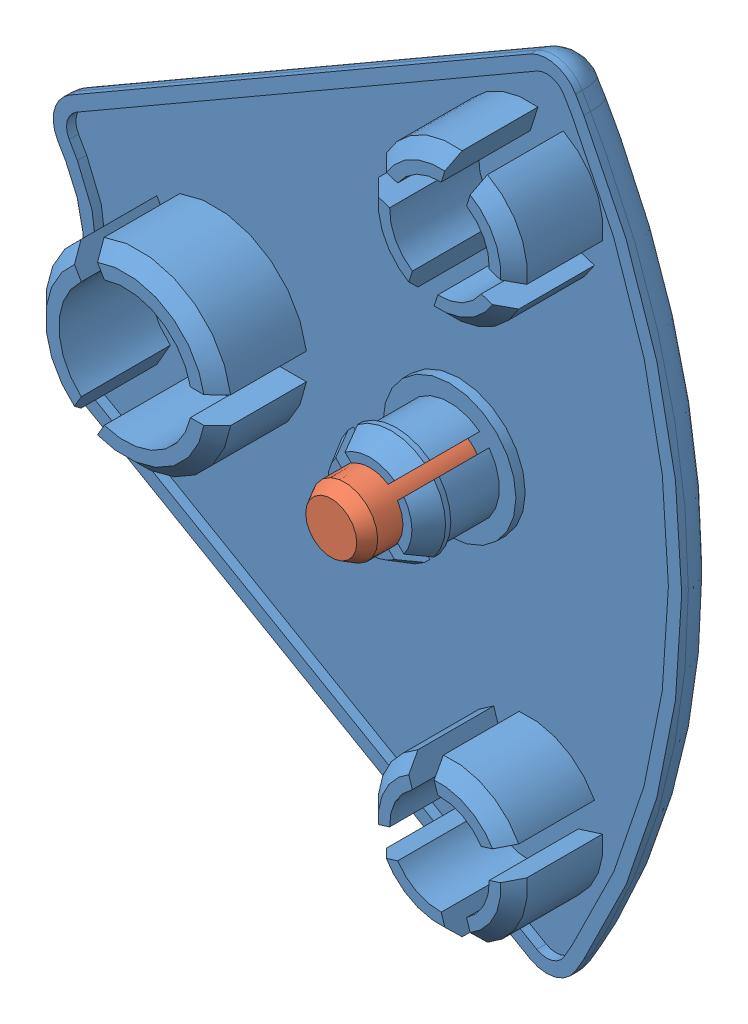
SolidWorks assembly 22.1018_1 END CAP 45 R 60 DEG GRAY.SLDASM, configuration Default (file format 3800). Lengths in mm.
Overall size (47.29 59.64 11.9).
2 component instances, 2 part files, 2 mates.
Components (placement in the parent):
- 22.1018_1 END CAP 45 R 60 DEG GRAY-1: 22.1018_1 END CAP 45 R 60 DEG GRAY.SLDPRT [Default] at origin size (47.29 59.64 9)
- 22_1017_1 END CAP DOWEL-1: 22_1017_1 END CAP DOWEL.SLDPRT [Default] at (-226.2859 -77.9472 10) size (5 5 11.9)
Mates (geometry in assembly coordinates):
- Concentric1: concentric: cylinder of 22.1018_1 END CAP 45 R 60 DEG GRAY-1; cylinder of ?
- Coincident1: coincident aligned: plane of 22.1018_1 END CAP 45 R 60 DEG GRAY-1 through (-3.4122 0 -3) normal (0 0 -1); plane of ? through (0 0 57.6688) normal (0 0 -1)
